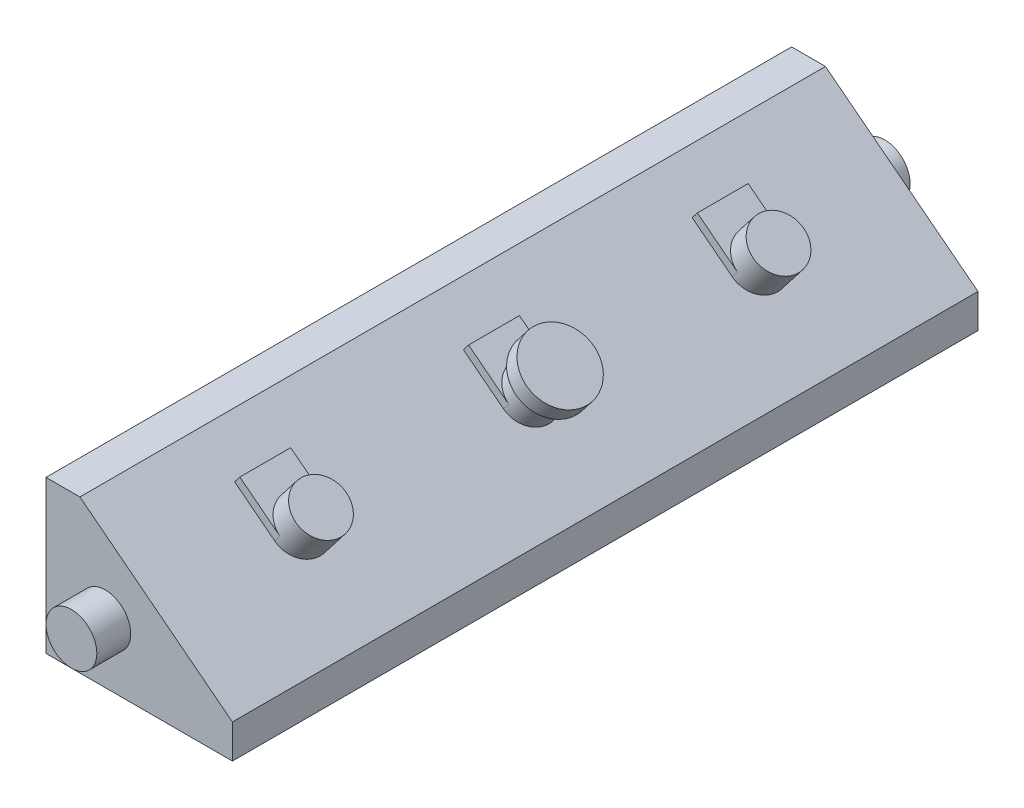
ISO-10303-21;
HEADER;
FILE_DESCRIPTION(('STEP AP214'),'2;1');
FILE_NAME('part.step','',(''),(''),'','','');
FILE_SCHEMA(('AUTOMOTIVE_DESIGN { 1 0 10303 214 1 1 1 1 }'));
ENDSEC;
DATA;
#1=APPLICATION_CONTEXT('core data for automotive mechanical design processes');
#2=APPLICATION_PROTOCOL_DEFINITION('international standard','automotive_design',2000,#1);
#3=PRODUCT_CONTEXT('',#1,'mechanical');
#4=PRODUCT('Part','Part','',(#3));
#5=PRODUCT_RELATED_PRODUCT_CATEGORY('part','',(#4));
#6=PRODUCT_DEFINITION_FORMATION('','',#4);
#7=PRODUCT_DEFINITION_CONTEXT('part definition',#1,'design');
#8=PRODUCT_DEFINITION('design','',#6,#7);
#9=PRODUCT_DEFINITION_SHAPE('','',#8);
#10=(LENGTH_UNIT() NAMED_UNIT(*) SI_UNIT(.MILLI.,.METRE.));
#11=(NAMED_UNIT(*) PLANE_ANGLE_UNIT() SI_UNIT($,.RADIAN.));
#12=(NAMED_UNIT(*) SI_UNIT($,.STERADIAN.) SOLID_ANGLE_UNIT());
#13=UNCERTAINTY_MEASURE_WITH_UNIT(LENGTH_MEASURE(1.E-05),#10,'distance_accuracy_value','');
#14=(GEOMETRIC_REPRESENTATION_CONTEXT(3) GLOBAL_UNCERTAINTY_ASSIGNED_CONTEXT((#13)) GLOBAL_UNIT_ASSIGNED_CONTEXT((#10,
#11,#12)) REPRESENTATION_CONTEXT('',''));
#15=CARTESIAN_POINT('',(0.,0.,0.));
#16=DIRECTION('',(0.,0.,1.));
#17=DIRECTION('',(1.,0.,0.));
#18=AXIS2_PLACEMENT_3D('',#15,#16,#17);
#19=CARTESIAN_POINT('',(68.0697030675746,-31.0532389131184,220.));
#20=DIRECTION('',(-0.613940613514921,-0.789352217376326,0.));
#21=DIRECTION('',(0.789352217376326,-0.613940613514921,0.));
#22=AXIS2_PLACEMENT_3D('',#19,#20,#21);
#23=PLANE('',#22);
#24=CARTESIAN_POINT('',(68.0697030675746,-31.0532389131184,220.));
#25=DIRECTION('',(-0.613940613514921,-0.789352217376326,0.));
#26=DIRECTION('',(0.789352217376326,-0.613940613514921,0.));
#27=AXIS2_PLACEMENT_3D('',#24,#25,#26);
#28=CIRCLE('',#27,15.);
#29=CARTESIAN_POINT('',(68.0697030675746,-31.0532389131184,205.));
#30=VERTEX_POINT('',#29);
#31=CARTESIAN_POINT('',(68.0697030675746,-31.0532389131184,235.));
#32=VERTEX_POINT('',#31);
#33=EDGE_CURVE('E164',#30,#32,#28,.F.);
#34=ORIENTED_EDGE('',*,*,#33,.F.);
#35=DIRECTION('',(-0.789352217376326,0.613940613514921,0.));
#36=VECTOR('',#35,1.);
#37=CARTESIAN_POINT('',(68.0697030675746,-31.0532389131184,205.));
#38=LINE('',#37,#36);
#39=CARTESIAN_POINT('',(44.3891365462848,-12.6350205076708,205.));
#40=VERTEX_POINT('',#39);
#41=EDGE_CURVE('E239',#30,#40,#38,.T.);
#42=ORIENTED_EDGE('',*,*,#41,.T.);
#43=DIRECTION('',(0.,0.,1.));
#44=VECTOR('',#43,1.);
#45=CARTESIAN_POINT('',(44.3891365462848,-12.6350205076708,205.));
#46=LINE('',#45,#44);
#47=CARTESIAN_POINT('',(44.3891365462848,-12.6350205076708,235.));
#48=VERTEX_POINT('',#47);
#49=EDGE_CURVE('E244',#40,#48,#46,.T.);
#50=ORIENTED_EDGE('',*,*,#49,.T.);
#51=DIRECTION('',(0.789352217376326,-0.613940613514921,0.));
#52=VECTOR('',#51,1.);
#53=CARTESIAN_POINT('',(68.0697030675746,-31.0532389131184,235.));
#54=LINE('',#53,#52);
#55=EDGE_CURVE('E242',#48,#32,#54,.T.);
#56=ORIENTED_EDGE('',*,*,#55,.T.);
#57=EDGE_LOOP('',(#34,#42,#50,#56));
#58=FACE_BOUND('',#57,.T.);
#59=ADVANCED_FACE('F37',(#58),#23,.F.);
#60=CARTESIAN_POINT('',(68.0697030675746,-31.0532389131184,355.));
#61=DIRECTION('',(-0.613940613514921,-0.789352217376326,0.));
#62=DIRECTION('',(0.789352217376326,-0.613940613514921,0.));
#63=AXIS2_PLACEMENT_3D('',#60,#61,#62);
#64=PLANE('',#63);
#65=CARTESIAN_POINT('',(68.0697030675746,-31.0532389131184,355.));
#66=DIRECTION('',(-0.613940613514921,-0.789352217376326,0.));
#67=DIRECTION('',(0.789352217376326,-0.613940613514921,0.));
#68=AXIS2_PLACEMENT_3D('',#65,#66,#67);
#69=CIRCLE('',#68,15.);
#70=CARTESIAN_POINT('',(68.0697030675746,-31.0532389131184,340.));
#71=VERTEX_POINT('',#70);
#72=CARTESIAN_POINT('',(68.0697030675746,-31.0532389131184,370.));
#73=VERTEX_POINT('',#72);
#74=EDGE_CURVE('E224',#71,#73,#69,.F.);
#75=ORIENTED_EDGE('',*,*,#74,.F.);
#76=DIRECTION('',(-0.789352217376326,0.613940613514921,0.));
#77=VECTOR('',#76,1.);
#78=CARTESIAN_POINT('',(68.0697030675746,-31.0532389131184,340.));
#79=LINE('',#78,#77);
#80=CARTESIAN_POINT('',(44.3891365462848,-12.6350205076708,340.));
#81=VERTEX_POINT('',#80);
#82=EDGE_CURVE('E263',#71,#81,#79,.T.);
#83=ORIENTED_EDGE('',*,*,#82,.T.);
#84=DIRECTION('',(0.,0.,1.));
#85=VECTOR('',#84,1.);
#86=CARTESIAN_POINT('',(44.3891365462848,-12.6350205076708,340.));
#87=LINE('',#86,#85);
#88=CARTESIAN_POINT('',(44.3891365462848,-12.6350205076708,370.));
#89=VERTEX_POINT('',#88);
#90=EDGE_CURVE('E265',#81,#89,#87,.T.);
#91=ORIENTED_EDGE('',*,*,#90,.T.);
#92=DIRECTION('',(0.789352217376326,-0.613940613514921,0.));
#93=VECTOR('',#92,1.);
#94=CARTESIAN_POINT('',(68.0697030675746,-31.0532389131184,370.));
#95=LINE('',#94,#93);
#96=EDGE_CURVE('E268',#89,#73,#95,.T.);
#97=ORIENTED_EDGE('',*,*,#96,.T.);
#98=EDGE_LOOP('',(#75,#83,#91,#97));
#99=FACE_BOUND('',#98,.T.);
#100=ADVANCED_FACE('F318',(#99),#64,.F.);
#101=CARTESIAN_POINT('',(20.,0.,440.));
#102=DIRECTION('',(-0.61394061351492,-0.789352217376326,0.));
#103=DIRECTION('',(0.789352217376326,-0.61394061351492,0.));
#104=AXIS2_PLACEMENT_3D('',#101,#102,#103);
#105=PLANE('',#104);
#106=CARTESIAN_POINT('',(65.,-35.,355.));
#107=DIRECTION('',(0.613940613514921,0.789352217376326,0.));
#108=DIRECTION('',(0.789352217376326,-0.613940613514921,0.));
#109=AXIS2_PLACEMENT_3D('',#106,#107,#108);
#110=CIRCLE('',#109,15.);
#111=CARTESIAN_POINT('',(65.,-35.,370.));
#112=VERTEX_POINT('',#111);
#113=CARTESIAN_POINT('',(65.,-35.,340.));
#114=VERTEX_POINT('',#113);
#115=EDGE_CURVE('E262',#112,#114,#110,.T.);
#116=ORIENTED_EDGE('',*,*,#115,.F.);
#117=DIRECTION('',(0.789352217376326,-0.613940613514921,0.));
#118=VECTOR('',#117,1.);
#119=CARTESIAN_POINT('',(65.,-35.,370.));
#120=LINE('',#119,#118);
#121=CARTESIAN_POINT('',(41.3194334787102,-16.5817815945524,370.));
#122=VERTEX_POINT('',#121);
#123=EDGE_CURVE('E266',#122,#112,#120,.T.);
#124=ORIENTED_EDGE('',*,*,#123,.F.);
#125=DIRECTION('',(0.,0.,1.));
#126=VECTOR('',#125,1.);
#127=CARTESIAN_POINT('',(41.3194334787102,-16.5817815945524,340.));
#128=LINE('',#127,#126);
#129=CARTESIAN_POINT('',(41.3194334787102,-16.5817815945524,340.));
#130=VERTEX_POINT('',#129);
#131=EDGE_CURVE('E276',#130,#122,#128,.T.);
#132=ORIENTED_EDGE('',*,*,#131,.F.);
#133=DIRECTION('',(-0.789352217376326,0.613940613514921,0.));
#134=VECTOR('',#133,1.);
#135=CARTESIAN_POINT('',(65.,-35.,340.));
#136=LINE('',#135,#134);
#137=EDGE_CURVE('E273',#114,#130,#136,.T.);
#138=ORIENTED_EDGE('',*,*,#137,.F.);
#139=EDGE_LOOP('',(#116,#124,#132,#138));
#140=FACE_BOUND('',#139,.T.);
#141=DIRECTION('',(-0.789352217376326,0.61394061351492,0.));
#142=VECTOR('',#141,1.);
#143=CARTESIAN_POINT('',(20.,0.,0.));
#144=LINE('',#143,#142);
#145=CARTESIAN_POINT('',(110.,-70.,0.));
#146=VERTEX_POINT('',#145);
#147=CARTESIAN_POINT('',(20.,0.,0.));
#148=VERTEX_POINT('',#147);
#149=EDGE_CURVE('E192',#146,#148,#144,.T.);
#150=ORIENTED_EDGE('',*,*,#149,.T.);
#151=DIRECTION('',(0.,0.,-1.));
#152=VECTOR('',#151,1.);
#153=CARTESIAN_POINT('',(20.,0.,440.));
#154=LINE('',#153,#152);
#155=CARTESIAN_POINT('',(20.,0.,440.));
#156=VERTEX_POINT('',#155);
#157=EDGE_CURVE('E200',#156,#148,#154,.T.);
#158=ORIENTED_EDGE('',*,*,#157,.F.);
#159=DIRECTION('',(-0.789352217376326,0.61394061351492,0.));
#160=VECTOR('',#159,1.);
#161=CARTESIAN_POINT('',(20.,0.,440.));
#162=LINE('',#161,#160);
#163=CARTESIAN_POINT('',(110.,-70.,440.));
#164=VERTEX_POINT('',#163);
#165=EDGE_CURVE('E198',#164,#156,#162,.T.);
#166=ORIENTED_EDGE('',*,*,#165,.F.);
#167=DIRECTION('',(0.,0.,-1.));
#168=VECTOR('',#167,1.);
#169=CARTESIAN_POINT('',(110.,-70.,440.));
#170=LINE('',#169,#168);
#171=EDGE_CURVE('E212',#164,#146,#170,.T.);
#172=ORIENTED_EDGE('',*,*,#171,.T.);
#173=EDGE_LOOP('',(#150,#158,#166,#172));
#174=FACE_BOUND('',#173,.T.);
#175=CARTESIAN_POINT('',(65.,-35.,85.));
#176=DIRECTION('',(0.613940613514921,0.789352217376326,0.));
#177=DIRECTION('',(-0.789352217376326,0.613940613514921,0.));
#178=AXIS2_PLACEMENT_3D('',#175,#176,#177);
#179=CIRCLE('',#178,15.);
#180=CARTESIAN_POINT('',(65.,-35.,100.));
#181=VERTEX_POINT('',#180);
#182=CARTESIAN_POINT('',(65.,-35.,70.));
#183=VERTEX_POINT('',#182);
#184=EDGE_CURVE('E292',#181,#183,#179,.T.);
#185=ORIENTED_EDGE('',*,*,#184,.F.);
#186=DIRECTION('',(0.789352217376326,-0.613940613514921,0.));
#187=VECTOR('',#186,1.);
#188=CARTESIAN_POINT('',(65.,-35.,100.));
#189=LINE('',#188,#187);
#190=CARTESIAN_POINT('',(41.3194334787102,-16.5817815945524,100.));
#191=VERTEX_POINT('',#190);
#192=EDGE_CURVE('E176',#191,#181,#189,.T.);
#193=ORIENTED_EDGE('',*,*,#192,.F.);
#194=DIRECTION('',(0.,0.,1.));
#195=VECTOR('',#194,1.);
#196=CARTESIAN_POINT('',(41.3194334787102,-16.5817815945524,100.));
#197=LINE('',#196,#195);
#198=CARTESIAN_POINT('',(41.3194334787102,-16.5817815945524,70.));
#199=VERTEX_POINT('',#198);
#200=EDGE_CURVE('E299',#199,#191,#197,.T.);
#201=ORIENTED_EDGE('',*,*,#200,.F.);
#202=DIRECTION('',(-0.789352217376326,0.613940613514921,0.));
#203=VECTOR('',#202,1.);
#204=CARTESIAN_POINT('',(65.,-35.,70.));
#205=LINE('',#204,#203);
#206=EDGE_CURVE('E297',#183,#199,#205,.T.);
#207=ORIENTED_EDGE('',*,*,#206,.F.);
#208=EDGE_LOOP('',(#185,#193,#201,#207));
#209=FACE_BOUND('',#208,.T.);
#210=CARTESIAN_POINT('',(65.,-35.,220.));
#211=DIRECTION('',(0.613940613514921,0.789352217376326,0.));
#212=DIRECTION('',(0.789352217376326,-0.613940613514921,0.));
#213=AXIS2_PLACEMENT_3D('',#210,#211,#212);
#214=CIRCLE('',#213,15.);
#215=CARTESIAN_POINT('',(65.,-35.,235.));
#216=VERTEX_POINT('',#215);
#217=CARTESIAN_POINT('',(65.,-35.,205.));
#218=VERTEX_POINT('',#217);
#219=EDGE_CURVE('E656',#216,#218,#214,.T.);
#220=ORIENTED_EDGE('',*,*,#219,.F.);
#221=DIRECTION('',(0.789352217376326,-0.613940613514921,0.));
#222=VECTOR('',#221,1.);
#223=CARTESIAN_POINT('',(65.,-35.,235.));
#224=LINE('',#223,#222);
#225=CARTESIAN_POINT('',(41.3194334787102,-16.5817815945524,235.));
#226=VERTEX_POINT('',#225);
#227=EDGE_CURVE('E251',#226,#216,#224,.T.);
#228=ORIENTED_EDGE('',*,*,#227,.F.);
#229=DIRECTION('',(0.,0.,1.));
#230=VECTOR('',#229,1.);
#231=CARTESIAN_POINT('',(41.3194334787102,-16.5817815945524,205.));
#232=LINE('',#231,#230);
#233=CARTESIAN_POINT('',(41.3194334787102,-16.5817815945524,205.));
#234=VERTEX_POINT('',#233);
#235=EDGE_CURVE('E57',#234,#226,#232,.T.);
#236=ORIENTED_EDGE('',*,*,#235,.F.);
#237=DIRECTION('',(-0.789352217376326,0.613940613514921,0.));
#238=VECTOR('',#237,1.);
#239=CARTESIAN_POINT('',(65.,-35.,205.));
#240=LINE('',#239,#238);
#241=EDGE_CURVE('E52',#218,#234,#240,.T.);
#242=ORIENTED_EDGE('',*,*,#241,.F.);
#243=EDGE_LOOP('',(#220,#228,#236,#242));
#244=FACE_BOUND('',#243,.T.);
#245=ADVANCED_FACE('F305',(#140,#174,#209,#244),#105,.F.);
#246=CARTESIAN_POINT('',(0.,0.,440.));
#247=DIRECTION('',(0.,-1.,0.));
#248=DIRECTION('',(0.,0.,-1.));
#249=AXIS2_PLACEMENT_3D('',#246,#247,#248);
#250=PLANE('',#249);
#251=DIRECTION('',(-1.,0.,0.));
#252=VECTOR('',#251,1.);
#253=CARTESIAN_POINT('',(0.,0.,0.));
#254=LINE('',#253,#252);
#255=CARTESIAN_POINT('',(0.,0.,0.));
#256=VERTEX_POINT('',#255);
#257=EDGE_CURVE('E187',#148,#256,#254,.T.);
#258=ORIENTED_EDGE('',*,*,#257,.T.);
#259=DIRECTION('',(0.,0.,-1.));
#260=VECTOR('',#259,1.);
#261=CARTESIAN_POINT('',(0.,0.,440.));
#262=LINE('',#261,#260);
#263=CARTESIAN_POINT('',(0.,0.,440.));
#264=VERTEX_POINT('',#263);
#265=EDGE_CURVE('E221',#264,#256,#262,.T.);
#266=ORIENTED_EDGE('',*,*,#265,.F.);
#267=DIRECTION('',(-1.,0.,0.));
#268=VECTOR('',#267,1.);
#269=CARTESIAN_POINT('',(0.,0.,440.));
#270=LINE('',#269,#268);
#271=EDGE_CURVE('E188',#156,#264,#270,.T.);
#272=ORIENTED_EDGE('',*,*,#271,.F.);
#273=ORIENTED_EDGE('',*,*,#157,.T.);
#274=EDGE_LOOP('',(#258,#266,#272,#273));
#275=FACE_BOUND('',#274,.T.);
#276=ADVANCED_FACE('F39',(#275),#250,.F.);
#277=CARTESIAN_POINT('',(0.,0.,440.));
#278=DIRECTION('',(1.,0.,0.));
#279=DIRECTION('',(0.,1.,0.));
#280=AXIS2_PLACEMENT_3D('',#277,#278,#279);
#281=PLANE('',#280);
#282=DIRECTION('',(0.,-1.,0.));
#283=VECTOR('',#282,1.);
#284=CARTESIAN_POINT('',(0.,0.,0.));
#285=LINE('',#284,#283);
#286=CARTESIAN_POINT('',(0.,-90.,0.));
#287=VERTEX_POINT('',#286);
#288=EDGE_CURVE('E203',#256,#287,#285,.T.);
#289=ORIENTED_EDGE('',*,*,#288,.T.);
#290=DIRECTION('',(0.,0.,-1.));
#291=VECTOR('',#290,1.);
#292=CARTESIAN_POINT('',(0.,-90.,440.));
#293=LINE('',#292,#291);
#294=CARTESIAN_POINT('',(0.,-90.,440.));
#295=VERTEX_POINT('',#294);
#296=EDGE_CURVE('E218',#295,#287,#293,.T.);
#297=ORIENTED_EDGE('',*,*,#296,.F.);
#298=DIRECTION('',(0.,-1.,0.));
#299=VECTOR('',#298,1.);
#300=CARTESIAN_POINT('',(0.,0.,440.));
#301=LINE('',#300,#299);
#302=EDGE_CURVE('E191',#264,#295,#301,.T.);
#303=ORIENTED_EDGE('',*,*,#302,.F.);
#304=ORIENTED_EDGE('',*,*,#265,.T.);
#305=EDGE_LOOP('',(#289,#297,#303,#304));
#306=FACE_BOUND('',#305,.T.);
#307=ADVANCED_FACE('F570',(#306),#281,.F.);
#308=CARTESIAN_POINT('',(0.,-90.,440.));
#309=DIRECTION('',(0.,1.,0.));
#310=DIRECTION('',(0.,0.,1.));
#311=AXIS2_PLACEMENT_3D('',#308,#309,#310);
#312=PLANE('',#311);
#313=DIRECTION('',(1.,0.,0.));
#314=VECTOR('',#313,1.);
#315=CARTESIAN_POINT('',(0.,-90.,0.));
#316=LINE('',#315,#314);
#317=CARTESIAN_POINT('',(110.,-90.,0.));
#318=VERTEX_POINT('',#317);
#319=EDGE_CURVE('E205',#287,#318,#316,.T.);
#320=ORIENTED_EDGE('',*,*,#319,.T.);
#321=DIRECTION('',(0.,0.,-1.));
#322=VECTOR('',#321,1.);
#323=CARTESIAN_POINT('',(110.,-90.,440.));
#324=LINE('',#323,#322);
#325=CARTESIAN_POINT('',(110.,-90.,440.));
#326=VERTEX_POINT('',#325);
#327=EDGE_CURVE('E215',#326,#318,#324,.T.);
#328=ORIENTED_EDGE('',*,*,#327,.F.);
#329=DIRECTION('',(1.,0.,0.));
#330=VECTOR('',#329,1.);
#331=CARTESIAN_POINT('',(0.,-90.,440.));
#332=LINE('',#331,#330);
#333=EDGE_CURVE('E194',#295,#326,#332,.T.);
#334=ORIENTED_EDGE('',*,*,#333,.F.);
#335=ORIENTED_EDGE('',*,*,#296,.T.);
#336=EDGE_LOOP('',(#320,#328,#334,#335));
#337=FACE_BOUND('',#336,.T.);
#338=ADVANCED_FACE('F558',(#337),#312,.F.);
#339=CARTESIAN_POINT('',(110.,-90.,440.));
#340=DIRECTION('',(-1.,0.,0.));
#341=DIRECTION('',(0.,0.,1.));
#342=AXIS2_PLACEMENT_3D('',#339,#340,#341);
#343=PLANE('',#342);
#344=DIRECTION('',(0.,1.,0.));
#345=VECTOR('',#344,1.);
#346=CARTESIAN_POINT('',(110.,-90.,0.));
#347=LINE('',#346,#345);
#348=EDGE_CURVE('E207',#318,#146,#347,.T.);
#349=ORIENTED_EDGE('',*,*,#348,.T.);
#350=ORIENTED_EDGE('',*,*,#171,.F.);
#351=DIRECTION('',(0.,1.,0.));
#352=VECTOR('',#351,1.);
#353=CARTESIAN_POINT('',(110.,-90.,440.));
#354=LINE('',#353,#352);
#355=EDGE_CURVE('E196',#326,#164,#354,.T.);
#356=ORIENTED_EDGE('',*,*,#355,.F.);
#357=ORIENTED_EDGE('',*,*,#327,.T.);
#358=EDGE_LOOP('',(#349,#350,#356,#357));
#359=FACE_BOUND('',#358,.T.);
#360=ADVANCED_FACE('F552',(#359),#343,.F.);
#361=CARTESIAN_POINT('',(0.,0.,440.));
#362=DIRECTION('',(0.,0.,1.));
#363=DIRECTION('',(1.,0.,0.));
#364=AXIS2_PLACEMENT_3D('',#361,#362,#363);
#365=PLANE('',#364);
#366=CARTESIAN_POINT('',(35.,-55.,440.));
#367=DIRECTION('',(0.,0.,1.));
#368=DIRECTION('',(1.,0.,0.));
#369=AXIS2_PLACEMENT_3D('',#366,#367,#368);
#370=CIRCLE('',#369,15.);
#371=CARTESIAN_POINT('',(50.,-55.,440.));
#372=VERTEX_POINT('',#371);
#373=EDGE_CURVE('E616',#372,#372,#370,.T.);
#374=ORIENTED_EDGE('',*,*,#373,.F.);
#375=EDGE_LOOP('',(#374));
#376=FACE_BOUND('',#375,.T.);
#377=ORIENTED_EDGE('',*,*,#271,.T.);
#378=ORIENTED_EDGE('',*,*,#302,.T.);
#379=ORIENTED_EDGE('',*,*,#333,.T.);
#380=ORIENTED_EDGE('',*,*,#355,.T.);
#381=ORIENTED_EDGE('',*,*,#165,.T.);
#382=EDGE_LOOP('',(#377,#378,#379,#380,#381));
#383=FACE_BOUND('',#382,.T.);
#384=ADVANCED_FACE('F557',(#376,#383),#365,.T.);
#385=CARTESIAN_POINT('',(0.,0.,0.));
#386=DIRECTION('',(0.,0.,1.));
#387=DIRECTION('',(1.,0.,0.));
#388=AXIS2_PLACEMENT_3D('',#385,#386,#387);
#389=PLANE('',#388);
#390=CARTESIAN_POINT('',(35.,-55.,0.));
#391=DIRECTION('',(0.,0.,1.));
#392=DIRECTION('',(1.,0.,0.));
#393=AXIS2_PLACEMENT_3D('',#390,#391,#392);
#394=CIRCLE('',#393,15.);
#395=CARTESIAN_POINT('',(50.,-55.,0.));
#396=VERTEX_POINT('',#395);
#397=EDGE_CURVE('E11',#396,#396,#394,.F.);
#398=ORIENTED_EDGE('',*,*,#397,.F.);
#399=EDGE_LOOP('',(#398));
#400=FACE_BOUND('',#399,.T.);
#401=ORIENTED_EDGE('',*,*,#257,.F.);
#402=ORIENTED_EDGE('',*,*,#149,.F.);
#403=ORIENTED_EDGE('',*,*,#348,.F.);
#404=ORIENTED_EDGE('',*,*,#319,.F.);
#405=ORIENTED_EDGE('',*,*,#288,.F.);
#406=EDGE_LOOP('',(#401,#402,#403,#404,#405));
#407=FACE_BOUND('',#406,.T.);
#408=ADVANCED_FACE('F315',(#400,#407),#389,.F.);
#409=CARTESIAN_POINT('',(68.0697030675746,-31.0532389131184,85.));
#410=DIRECTION('',(-0.613940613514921,-0.789352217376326,0.));
#411=DIRECTION('',(0.789352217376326,-0.613940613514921,0.));
#412=AXIS2_PLACEMENT_3D('',#409,#410,#411);
#413=CYLINDRICAL_SURFACE('',#412,15.);
#414=ORIENTED_EDGE('',*,*,#184,.T.);
#415=DIRECTION('',(-0.613940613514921,-0.789352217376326,0.));
#416=VECTOR('',#415,1.);
#417=CARTESIAN_POINT('',(68.0697030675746,-31.0532389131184,70.));
#418=LINE('',#417,#416);
#419=CARTESIAN_POINT('',(68.0697030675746,-31.0532389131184,70.));
#420=VERTEX_POINT('',#419);
#421=EDGE_CURVE('E161',#420,#183,#418,.T.);
#422=ORIENTED_EDGE('',*,*,#421,.F.);
#423=CARTESIAN_POINT('',(68.0697030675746,-31.0532389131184,85.));
#424=DIRECTION('',(0.613940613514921,0.789352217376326,0.));
#425=DIRECTION('',(-0.789352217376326,0.613940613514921,0.));
#426=AXIS2_PLACEMENT_3D('',#423,#424,#425);
#427=CIRCLE('',#426,15.);
#428=CARTESIAN_POINT('',(68.0697030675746,-31.0532389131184,100.));
#429=VERTEX_POINT('',#428);
#430=EDGE_CURVE('E45',#429,#420,#427,.F.);
#431=ORIENTED_EDGE('',*,*,#430,.F.);
#432=DIRECTION('',(-0.613940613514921,-0.789352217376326,0.));
#433=VECTOR('',#432,1.);
#434=CARTESIAN_POINT('',(68.0697030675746,-31.0532389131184,100.));
#435=LINE('',#434,#433);
#436=EDGE_CURVE('E159',#429,#181,#435,.T.);
#437=ORIENTED_EDGE('',*,*,#436,.T.);
#438=EDGE_LOOP('',(#414,#422,#431,#437));
#439=FACE_BOUND('',#438,.T.);
#440=CARTESIAN_POINT('',(77.2788122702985,-19.2129556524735,85.));
#441=DIRECTION('',(0.613940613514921,0.789352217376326,0.));
#442=DIRECTION('',(-0.789352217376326,0.613940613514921,0.));
#443=AXIS2_PLACEMENT_3D('',#440,#441,#442);
#444=CIRCLE('',#443,15.);
#445=CARTESIAN_POINT('',(65.4385290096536,-10.0038464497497,85.));
#446=VERTEX_POINT('',#445);
#447=EDGE_CURVE('E645',#446,#446,#444,.T.);
#448=ORIENTED_EDGE('',*,*,#447,.F.);
#449=EDGE_LOOP('',(#448));
#450=FACE_BOUND('',#449,.T.);
#451=ADVANCED_FACE('F156',(#439,#450),#413,.T.);
#452=CARTESIAN_POINT('',(68.0697030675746,-31.0532389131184,70.));
#453=DIRECTION('',(0.,0.,1.));
#454=DIRECTION('',(1.,0.,0.));
#455=AXIS2_PLACEMENT_3D('',#452,#453,#454);
#456=PLANE('',#455);
#457=ORIENTED_EDGE('',*,*,#206,.T.);
#458=DIRECTION('',(-0.613940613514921,-0.789352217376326,0.));
#459=VECTOR('',#458,1.);
#460=CARTESIAN_POINT('',(44.3891365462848,-12.6350205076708,70.));
#461=LINE('',#460,#459);
#462=CARTESIAN_POINT('',(44.3891365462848,-12.6350205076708,70.));
#463=VERTEX_POINT('',#462);
#464=EDGE_CURVE('E179',#463,#199,#461,.T.);
#465=ORIENTED_EDGE('',*,*,#464,.F.);
#466=DIRECTION('',(-0.789352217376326,0.613940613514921,0.));
#467=VECTOR('',#466,1.);
#468=CARTESIAN_POINT('',(68.0697030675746,-31.0532389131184,70.));
#469=LINE('',#468,#467);
#470=EDGE_CURVE('E293',#420,#463,#469,.T.);
#471=ORIENTED_EDGE('',*,*,#470,.F.);
#472=ORIENTED_EDGE('',*,*,#421,.T.);
#473=EDGE_LOOP('',(#457,#465,#471,#472));
#474=FACE_BOUND('',#473,.T.);
#475=ADVANCED_FACE('F307',(#474),#456,.F.);
#476=CARTESIAN_POINT('',(44.3891365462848,-12.6350205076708,100.));
#477=DIRECTION('',(0.789352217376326,-0.613940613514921,0.));
#478=DIRECTION('',(0.613940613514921,0.789352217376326,0.));
#479=AXIS2_PLACEMENT_3D('',#476,#477,#478);
#480=PLANE('',#479);
#481=ORIENTED_EDGE('',*,*,#200,.T.);
#482=DIRECTION('',(-0.613940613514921,-0.789352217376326,0.));
#483=VECTOR('',#482,1.);
#484=CARTESIAN_POINT('',(44.3891365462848,-12.6350205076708,100.));
#485=LINE('',#484,#483);
#486=CARTESIAN_POINT('',(44.3891365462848,-12.6350205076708,100.));
#487=VERTEX_POINT('',#486);
#488=EDGE_CURVE('E177',#487,#191,#485,.T.);
#489=ORIENTED_EDGE('',*,*,#488,.F.);
#490=DIRECTION('',(0.,0.,1.));
#491=VECTOR('',#490,1.);
#492=CARTESIAN_POINT('',(44.3891365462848,-12.6350205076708,100.));
#493=LINE('',#492,#491);
#494=EDGE_CURVE('E169',#463,#487,#493,.T.);
#495=ORIENTED_EDGE('',*,*,#494,.F.);
#496=ORIENTED_EDGE('',*,*,#464,.T.);
#497=EDGE_LOOP('',(#481,#489,#495,#496));
#498=FACE_BOUND('',#497,.T.);
#499=ADVANCED_FACE('F302',(#498),#480,.F.);
#500=CARTESIAN_POINT('',(68.0697030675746,-31.0532389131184,100.));
#501=DIRECTION('',(0.,0.,-1.));
#502=DIRECTION('',(-1.,0.,0.));
#503=AXIS2_PLACEMENT_3D('',#500,#501,#502);
#504=PLANE('',#503);
#505=ORIENTED_EDGE('',*,*,#192,.T.);
#506=ORIENTED_EDGE('',*,*,#436,.F.);
#507=DIRECTION('',(0.789352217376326,-0.613940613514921,0.));
#508=VECTOR('',#507,1.);
#509=CARTESIAN_POINT('',(68.0697030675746,-31.0532389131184,100.));
#510=LINE('',#509,#508);
#511=EDGE_CURVE('E166',#487,#429,#510,.T.);
#512=ORIENTED_EDGE('',*,*,#511,.F.);
#513=ORIENTED_EDGE('',*,*,#488,.T.);
#514=EDGE_LOOP('',(#505,#506,#512,#513));
#515=FACE_BOUND('',#514,.T.);
#516=ADVANCED_FACE('F175',(#515),#504,.F.);
#517=CARTESIAN_POINT('',(68.0697030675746,-31.0532389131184,85.));
#518=DIRECTION('',(0.613940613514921,0.789352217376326,0.));
#519=DIRECTION('',(-0.789352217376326,0.613940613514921,0.));
#520=AXIS2_PLACEMENT_3D('',#517,#518,#519);
#521=PLANE('',#520);
#522=ORIENTED_EDGE('',*,*,#511,.T.);
#523=ORIENTED_EDGE('',*,*,#430,.T.);
#524=ORIENTED_EDGE('',*,*,#470,.T.);
#525=ORIENTED_EDGE('',*,*,#494,.T.);
#526=EDGE_LOOP('',(#522,#523,#524,#525));
#527=FACE_BOUND('',#526,.T.);
#528=ADVANCED_FACE('F167',(#527),#521,.T.);
#529=CARTESIAN_POINT('',(68.0697030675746,-31.0532389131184,355.));
#530=DIRECTION('',(-0.613940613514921,-0.789352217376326,0.));
#531=DIRECTION('',(0.789352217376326,-0.613940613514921,0.));
#532=AXIS2_PLACEMENT_3D('',#529,#530,#531);
#533=CYLINDRICAL_SURFACE('',#532,15.);
#534=ORIENTED_EDGE('',*,*,#115,.T.);
#535=DIRECTION('',(-0.613940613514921,-0.789352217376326,0.));
#536=VECTOR('',#535,1.);
#537=CARTESIAN_POINT('',(68.0697030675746,-31.0532389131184,340.));
#538=LINE('',#537,#536);
#539=EDGE_CURVE('E289',#71,#114,#538,.T.);
#540=ORIENTED_EDGE('',*,*,#539,.F.);
#541=ORIENTED_EDGE('',*,*,#74,.T.);
#542=DIRECTION('',(-0.613940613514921,-0.789352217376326,0.));
#543=VECTOR('',#542,1.);
#544=CARTESIAN_POINT('',(68.0697030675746,-31.0532389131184,370.));
#545=LINE('',#544,#543);
#546=EDGE_CURVE('E270',#73,#112,#545,.T.);
#547=ORIENTED_EDGE('',*,*,#546,.T.);
#548=EDGE_LOOP('',(#534,#540,#541,#547));
#549=FACE_BOUND('',#548,.T.);
#550=CARTESIAN_POINT('',(77.2788122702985,-19.2129556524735,355.));
#551=DIRECTION('',(0.613940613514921,0.789352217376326,0.));
#552=DIRECTION('',(-0.789352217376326,0.613940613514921,0.));
#553=AXIS2_PLACEMENT_3D('',#550,#551,#552);
#554=CIRCLE('',#553,15.);
#555=CARTESIAN_POINT('',(65.4385290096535,-10.0038464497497,355.));
#556=VERTEX_POINT('',#555);
#557=EDGE_CURVE('E653',#556,#556,#554,.T.);
#558=ORIENTED_EDGE('',*,*,#557,.F.);
#559=EDGE_LOOP('',(#558));
#560=FACE_BOUND('',#559,.T.);
#561=ADVANCED_FACE('F353',(#549,#560),#533,.T.);
#562=CARTESIAN_POINT('',(68.0697030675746,-31.0532389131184,340.));
#563=DIRECTION('',(0.,0.,1.));
#564=DIRECTION('',(1.,0.,0.));
#565=AXIS2_PLACEMENT_3D('',#562,#563,#564);
#566=PLANE('',#565);
#567=ORIENTED_EDGE('',*,*,#137,.T.);
#568=DIRECTION('',(-0.613940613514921,-0.789352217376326,0.));
#569=VECTOR('',#568,1.);
#570=CARTESIAN_POINT('',(44.3891365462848,-12.6350205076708,340.));
#571=LINE('',#570,#569);
#572=EDGE_CURVE('E286',#81,#130,#571,.T.);
#573=ORIENTED_EDGE('',*,*,#572,.F.);
#574=ORIENTED_EDGE('',*,*,#82,.F.);
#575=ORIENTED_EDGE('',*,*,#539,.T.);
#576=EDGE_LOOP('',(#567,#573,#574,#575));
#577=FACE_BOUND('',#576,.T.);
#578=ADVANCED_FACE('F349',(#577),#566,.F.);
#579=CARTESIAN_POINT('',(44.3891365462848,-12.6350205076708,340.));
#580=DIRECTION('',(0.789352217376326,-0.613940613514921,0.));
#581=DIRECTION('',(0.613940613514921,0.789352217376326,0.));
#582=AXIS2_PLACEMENT_3D('',#579,#580,#581);
#583=PLANE('',#582);
#584=ORIENTED_EDGE('',*,*,#131,.T.);
#585=DIRECTION('',(-0.613940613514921,-0.789352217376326,0.));
#586=VECTOR('',#585,1.);
#587=CARTESIAN_POINT('',(44.3891365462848,-12.6350205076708,370.));
#588=LINE('',#587,#586);
#589=EDGE_CURVE('E283',#89,#122,#588,.T.);
#590=ORIENTED_EDGE('',*,*,#589,.F.);
#591=ORIENTED_EDGE('',*,*,#90,.F.);
#592=ORIENTED_EDGE('',*,*,#572,.T.);
#593=EDGE_LOOP('',(#584,#590,#591,#592));
#594=FACE_BOUND('',#593,.T.);
#595=ADVANCED_FACE('F345',(#594),#583,.F.);
#596=CARTESIAN_POINT('',(68.0697030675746,-31.0532389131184,370.));
#597=DIRECTION('',(0.,0.,-1.));
#598=DIRECTION('',(-1.,0.,0.));
#599=AXIS2_PLACEMENT_3D('',#596,#597,#598);
#600=PLANE('',#599);
#601=ORIENTED_EDGE('',*,*,#123,.T.);
#602=ORIENTED_EDGE('',*,*,#546,.F.);
#603=ORIENTED_EDGE('',*,*,#96,.F.);
#604=ORIENTED_EDGE('',*,*,#589,.T.);
#605=EDGE_LOOP('',(#601,#602,#603,#604));
#606=FACE_BOUND('',#605,.T.);
#607=ADVANCED_FACE('F341',(#606),#600,.F.);
#608=CARTESIAN_POINT('',(68.0697030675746,-31.0532389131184,220.));
#609=DIRECTION('',(-0.613940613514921,-0.789352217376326,0.));
#610=DIRECTION('',(0.789352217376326,-0.613940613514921,0.));
#611=AXIS2_PLACEMENT_3D('',#608,#609,#610);
#612=CYLINDRICAL_SURFACE('',#611,15.);
#613=ORIENTED_EDGE('',*,*,#219,.T.);
#614=DIRECTION('',(-0.613940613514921,-0.789352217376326,0.));
#615=VECTOR('',#614,1.);
#616=CARTESIAN_POINT('',(68.0697030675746,-31.0532389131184,205.));
#617=LINE('',#616,#615);
#618=EDGE_CURVE('E236',#30,#218,#617,.T.);
#619=ORIENTED_EDGE('',*,*,#618,.F.);
#620=ORIENTED_EDGE('',*,*,#33,.T.);
#621=DIRECTION('',(-0.613940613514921,-0.789352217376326,0.));
#622=VECTOR('',#621,1.);
#623=CARTESIAN_POINT('',(68.0697030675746,-31.0532389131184,235.));
#624=LINE('',#623,#622);
#625=EDGE_CURVE('E235',#32,#216,#624,.T.);
#626=ORIENTED_EDGE('',*,*,#625,.T.);
#627=EDGE_LOOP('',(#613,#619,#620,#626));
#628=FACE_BOUND('',#627,.T.);
#629=CARTESIAN_POINT('',(77.2788122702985,-19.2129556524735,220.));
#630=DIRECTION('',(0.613940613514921,0.789352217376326,0.));
#631=DIRECTION('',(-0.789352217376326,0.613940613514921,0.));
#632=AXIS2_PLACEMENT_3D('',#629,#630,#631);
#633=CIRCLE('',#632,15.);
#634=CARTESIAN_POINT('',(65.4385290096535,-10.0038464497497,220.));
#635=VERTEX_POINT('',#634);
#636=EDGE_CURVE('E650',#635,#635,#633,.T.);
#637=ORIENTED_EDGE('',*,*,#636,.F.);
#638=EDGE_LOOP('',(#637));
#639=FACE_BOUND('',#638,.T.);
#640=ADVANCED_FACE('F232',(#628,#639),#612,.T.);
#641=CARTESIAN_POINT('',(68.0697030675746,-31.0532389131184,205.));
#642=DIRECTION('',(0.,0.,1.));
#643=DIRECTION('',(1.,0.,0.));
#644=AXIS2_PLACEMENT_3D('',#641,#642,#643);
#645=PLANE('',#644);
#646=ORIENTED_EDGE('',*,*,#241,.T.);
#647=DIRECTION('',(-0.613940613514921,-0.789352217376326,0.));
#648=VECTOR('',#647,1.);
#649=CARTESIAN_POINT('',(44.3891365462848,-12.6350205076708,205.));
#650=LINE('',#649,#648);
#651=EDGE_CURVE('E254',#40,#234,#650,.T.);
#652=ORIENTED_EDGE('',*,*,#651,.F.);
#653=ORIENTED_EDGE('',*,*,#41,.F.);
#654=ORIENTED_EDGE('',*,*,#618,.T.);
#655=EDGE_LOOP('',(#646,#652,#653,#654));
#656=FACE_BOUND('',#655,.T.);
#657=ADVANCED_FACE('F335',(#656),#645,.F.);
#658=CARTESIAN_POINT('',(44.3891365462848,-12.6350205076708,205.));
#659=DIRECTION('',(0.789352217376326,-0.613940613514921,0.));
#660=DIRECTION('',(0.613940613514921,0.789352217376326,0.));
#661=AXIS2_PLACEMENT_3D('',#658,#659,#660);
#662=PLANE('',#661);
#663=ORIENTED_EDGE('',*,*,#235,.T.);
#664=DIRECTION('',(-0.613940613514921,-0.789352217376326,0.));
#665=VECTOR('',#664,1.);
#666=CARTESIAN_POINT('',(44.3891365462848,-12.6350205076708,235.));
#667=LINE('',#666,#665);
#668=EDGE_CURVE('E252',#48,#226,#667,.T.);
#669=ORIENTED_EDGE('',*,*,#668,.F.);
#670=ORIENTED_EDGE('',*,*,#49,.F.);
#671=ORIENTED_EDGE('',*,*,#651,.T.);
#672=EDGE_LOOP('',(#663,#669,#670,#671));
#673=FACE_BOUND('',#672,.T.);
#674=ADVANCED_FACE('F332',(#673),#662,.F.);
#675=CARTESIAN_POINT('',(68.0697030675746,-31.0532389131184,235.));
#676=DIRECTION('',(0.,0.,-1.));
#677=DIRECTION('',(-1.,0.,0.));
#678=AXIS2_PLACEMENT_3D('',#675,#676,#677);
#679=PLANE('',#678);
#680=ORIENTED_EDGE('',*,*,#227,.T.);
#681=ORIENTED_EDGE('',*,*,#625,.F.);
#682=ORIENTED_EDGE('',*,*,#55,.F.);
#683=ORIENTED_EDGE('',*,*,#668,.T.);
#684=EDGE_LOOP('',(#680,#681,#682,#683));
#685=FACE_BOUND('',#684,.T.);
#686=ADVANCED_FACE('F250',(#685),#679,.F.);
#687=CARTESIAN_POINT('',(77.2788122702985,-19.2129556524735,355.));
#688=DIRECTION('',(0.613940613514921,0.789352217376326,0.));
#689=DIRECTION('',(-0.789352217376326,0.613940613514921,0.));
#690=AXIS2_PLACEMENT_3D('',#687,#688,#689);
#691=PLANE('',#690);
#692=ORIENTED_EDGE('',*,*,#557,.T.);
#693=EDGE_LOOP('',(#692));
#694=FACE_BOUND('',#693,.T.);
#695=ADVANCED_FACE('F328',(#694),#691,.T.);
#696=CARTESIAN_POINT('',(77.2788122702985,-19.2129556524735,85.));
#697=DIRECTION('',(0.613940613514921,0.789352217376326,0.));
#698=DIRECTION('',(-0.789352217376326,0.613940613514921,0.));
#699=AXIS2_PLACEMENT_3D('',#696,#697,#698);
#700=PLANE('',#699);
#701=ORIENTED_EDGE('',*,*,#447,.T.);
#702=EDGE_LOOP('',(#701));
#703=FACE_BOUND('',#702,.T.);
#704=ADVANCED_FACE('F407',(#703),#700,.T.);
#705=CARTESIAN_POINT('',(83.4182184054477,-11.3194334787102,220.));
#706=DIRECTION('',(-0.613940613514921,-0.789352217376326,0.));
#707=DIRECTION('',(0.789352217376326,-0.613940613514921,0.));
#708=AXIS2_PLACEMENT_3D('',#705,#706,#707);
#709=CYLINDRICAL_SURFACE('',#708,20.);
#710=CARTESIAN_POINT('',(83.4182184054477,-11.3194334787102,220.));
#711=DIRECTION('',(0.613940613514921,0.789352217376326,0.));
#712=DIRECTION('',(-0.789352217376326,0.613940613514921,0.));
#713=AXIS2_PLACEMENT_3D('',#710,#711,#712);
#714=CIRCLE('',#713,20.);
#715=CARTESIAN_POINT('',(67.6311740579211,0.959378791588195,220.));
#716=VERTEX_POINT('',#715);
#717=EDGE_CURVE('E642',#716,#716,#714,.T.);
#718=ORIENTED_EDGE('',*,*,#717,.F.);
#719=EDGE_LOOP('',(#718));
#720=FACE_BOUND('',#719,.T.);
#721=CARTESIAN_POINT('',(77.2788122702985,-19.2129556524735,220.));
#722=DIRECTION('',(0.613940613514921,0.789352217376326,0.));
#723=DIRECTION('',(-0.789352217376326,0.613940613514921,0.));
#724=AXIS2_PLACEMENT_3D('',#721,#722,#723);
#725=CIRCLE('',#724,20.);
#726=CARTESIAN_POINT('',(61.4917679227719,-6.93414338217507,220.));
#727=VERTEX_POINT('',#726);
#728=EDGE_CURVE('E637',#727,#727,#725,.T.);
#729=ORIENTED_EDGE('',*,*,#728,.T.);
#730=EDGE_LOOP('',(#729));
#731=FACE_BOUND('',#730,.T.);
#732=ADVANCED_FACE('F414',(#720,#731),#709,.T.);
#733=CARTESIAN_POINT('',(83.4182184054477,-11.3194334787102,220.));
#734=DIRECTION('',(0.613940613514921,0.789352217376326,0.));
#735=DIRECTION('',(-0.789352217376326,0.613940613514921,0.));
#736=AXIS2_PLACEMENT_3D('',#733,#734,#735);
#737=PLANE('',#736);
#738=ORIENTED_EDGE('',*,*,#717,.T.);
#739=EDGE_LOOP('',(#738));
#740=FACE_BOUND('',#739,.T.);
#741=ADVANCED_FACE('F421',(#740),#737,.T.);
#742=CARTESIAN_POINT('',(77.2788122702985,-19.2129556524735,220.));
#743=DIRECTION('',(0.613940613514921,0.789352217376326,0.));
#744=DIRECTION('',(-0.789352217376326,0.613940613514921,0.));
#745=AXIS2_PLACEMENT_3D('',#742,#743,#744);
#746=PLANE('',#745);
#747=ORIENTED_EDGE('',*,*,#636,.T.);
#748=EDGE_LOOP('',(#747));
#749=FACE_BOUND('',#748,.T.);
#750=ORIENTED_EDGE('',*,*,#728,.F.);
#751=EDGE_LOOP('',(#750));
#752=FACE_BOUND('',#751,.T.);
#753=ADVANCED_FACE('F429',(#749,#752),#746,.F.);
#754=CARTESIAN_POINT('',(35.,-55.,460.));
#755=DIRECTION('',(0.,0.,-1.));
#756=DIRECTION('',(-1.,0.,0.));
#757=AXIS2_PLACEMENT_3D('',#754,#755,#756);
#758=CYLINDRICAL_SURFACE('',#757,15.);
#759=CARTESIAN_POINT('',(35.,-55.,460.));
#760=DIRECTION('',(0.,0.,1.));
#761=DIRECTION('',(1.,0.,0.));
#762=AXIS2_PLACEMENT_3D('',#759,#760,#761);
#763=CIRCLE('',#762,15.);
#764=CARTESIAN_POINT('',(50.,-55.,460.));
#765=VERTEX_POINT('',#764);
#766=EDGE_CURVE('E633',#765,#765,#763,.T.);
#767=ORIENTED_EDGE('',*,*,#766,.F.);
#768=EDGE_LOOP('',(#767));
#769=FACE_BOUND('',#768,.T.);
#770=ORIENTED_EDGE('',*,*,#373,.T.);
#771=EDGE_LOOP('',(#770));
#772=FACE_BOUND('',#771,.T.);
#773=ADVANCED_FACE('F437',(#769,#772),#758,.T.);
#774=CARTESIAN_POINT('',(35.,-55.,460.));
#775=DIRECTION('',(0.,0.,1.));
#776=DIRECTION('',(1.,0.,0.));
#777=AXIS2_PLACEMENT_3D('',#774,#775,#776);
#778=PLANE('',#777);
#779=ORIENTED_EDGE('',*,*,#766,.T.);
#780=EDGE_LOOP('',(#779));
#781=FACE_BOUND('',#780,.T.);
#782=ADVANCED_FACE('F446',(#781),#778,.T.);
#783=CARTESIAN_POINT('',(35.,-55.,-20.));
#784=DIRECTION('',(0.,0.,1.));
#785=DIRECTION('',(1.,0.,0.));
#786=AXIS2_PLACEMENT_3D('',#783,#784,#785);
#787=CYLINDRICAL_SURFACE('',#786,15.);
#788=CARTESIAN_POINT('',(35.,-55.,-20.));
#789=DIRECTION('',(0.,0.,-1.));
#790=DIRECTION('',(-1.,0.,0.));
#791=AXIS2_PLACEMENT_3D('',#788,#789,#790);
#792=CIRCLE('',#791,15.);
#793=CARTESIAN_POINT('',(20.,-55.,-20.));
#794=VERTEX_POINT('',#793);
#795=EDGE_CURVE('E634',#794,#794,#792,.T.);
#796=ORIENTED_EDGE('',*,*,#795,.F.);
#797=EDGE_LOOP('',(#796));
#798=FACE_BOUND('',#797,.T.);
#799=ORIENTED_EDGE('',*,*,#397,.T.);
#800=EDGE_LOOP('',(#799));
#801=FACE_BOUND('',#800,.T.);
#802=ADVANCED_FACE('F454',(#798,#801),#787,.T.);
#803=CARTESIAN_POINT('',(35.,-55.,-20.));
#804=DIRECTION('',(0.,0.,-1.));
#805=DIRECTION('',(-1.,0.,0.));
#806=AXIS2_PLACEMENT_3D('',#803,#804,#805);
#807=PLANE('',#806);
#808=ORIENTED_EDGE('',*,*,#795,.T.);
#809=EDGE_LOOP('',(#808));
#810=FACE_BOUND('',#809,.T.);
#811=ADVANCED_FACE('F463',(#810),#807,.T.);
#812=CLOSED_SHELL('',(#59,#100,#245,#276,#307,#338,#360,#384,#408,#451,#475,#499,#516,#528,#561,
#578,#595,#607,#640,#657,#674,#686,#695,#704,#732,#741,#753,#773,#782,#802,#811));
#813=MANIFOLD_SOLID_BREP('B2',#812);
#814=ADVANCED_BREP_SHAPE_REPRESENTATION('',(#18,#813),#14);
#815=SHAPE_DEFINITION_REPRESENTATION(#9,#814);
ENDSEC;
END-ISO-10303-21;
